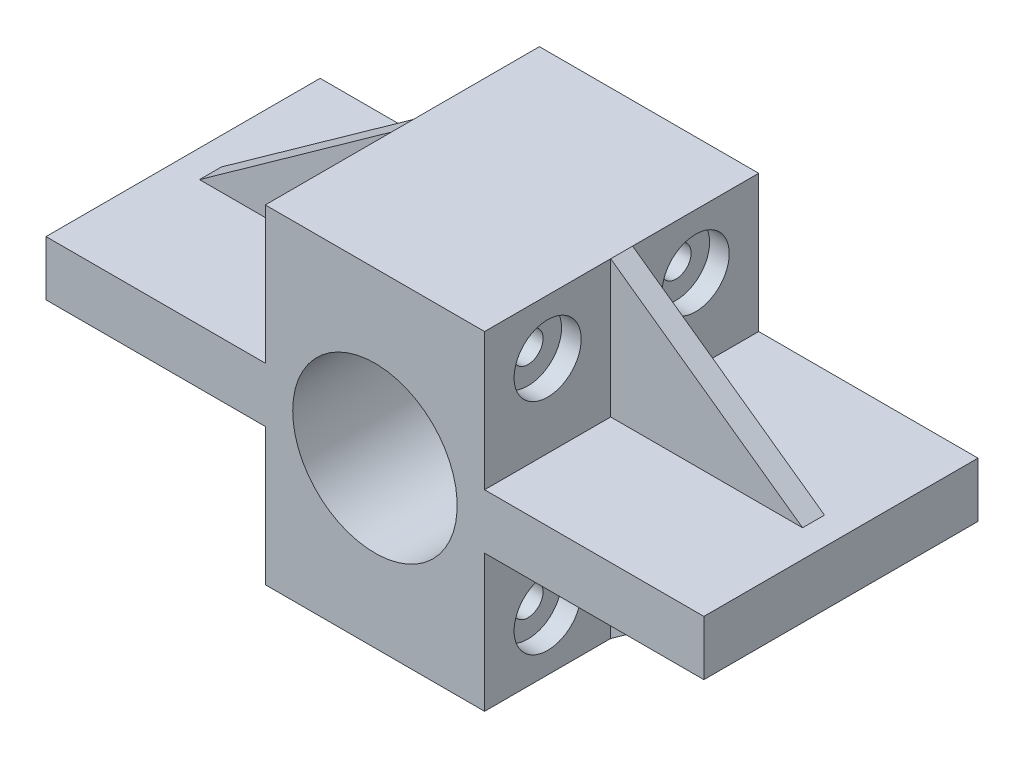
from build123d import *
from build123d.topology import SkipClean

# Parameters (mm, degrees)
EXTRUDE1_DEPTH                         = 25
RIB_REACH                              = 73.589
SKETCH4_WALL_W                         = 188.189836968
SKETCH4_WALL_H                         = 4
CBORE_FOR_M5_HEX_HEAD_BOLT3_AT_2_COUNT = 2
CBORE_FOR_M5_HEX_HEAD_BOLT3_AT_2_PITCH = 27


with BuildPart() as part:
    # Sketch1 → Extrude1 (new, symmetric)
    with BuildSketch(Plane.XY):
        with BuildLine():
            Line((-60, 0), (-15, 0))
            ThreePointArc((-15, 0), (0, 15), (15, 0))
            Line((15, 0), (60, 0))
            Line((60, 0), (60, 5))
            Line((60, 5), (20, 5))
            Line((20, 5), (20, 30))
            Line((20, 30), (-20, 30))
            Line((-20, 30), (-20, 5))
            Line((-20, 5), (-60, 5))
            Line((-60, 5), (-60, 0))
        make_face()
    extrude(amount=EXTRUDE1_DEPTH, both=True)

    # Sketch4 wall → Rib (add, up to next)
    with BuildSketch(Plane(origin=(37.5, 17.5, 0), x_dir=(0.813733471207, -0.581238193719, 0), z_dir=(0.581238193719, 0.813733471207, 0)), mode=Mode.PRIVATE) as rib_sk1:
        Rectangle(SKETCH4_WALL_W, SKETCH4_WALL_H)
    rib_tool1 = extrude(rib_sk1.sketch, amount=-RIB_REACH, mode=Mode.PRIVATE) - part.part
    rib = rib_tool1.solids().sort_by_distance((37.5, 17.5, 0))[0]
    add(rib)

    # Sketch10 → CBORE for M5 Hex Head Bolt3 (revolve, cut)
    with BuildSketch(Plane(origin=(20, 20, 13.5), x_dir=(0, 0, -1), z_dir=(0, 1, 0))):
        Polygon((0, 0), (0, 11.652366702), (2.75, 10), (2.75, 3.58), (6.12, 3.58), (6.12, 0), align=None)
    cbore_for_m5_hex_head_bolt3 = revolve(axis=Axis((26.35, 20, 13.5), (-1, 0, 0)), mode=Mode.SUBTRACT)

    # CBORE for M5 Hex Head Bolt3 at 2: CBORE for M5 Hex Head Bolt3 ×2
    with Locations(*[(0, 0, -i * CBORE_FOR_M5_HEX_HEAD_BOLT3_AT_2_PITCH) for i in range(1, CBORE_FOR_M5_HEX_HEAD_BOLT3_AT_2_COUNT)]):
        add(cbore_for_m5_hex_head_bolt3, mode=Mode.SUBTRACT)

    # Mirror13: Rib, CBORE for M5 Hex Head Bolt3 across plane
    add(rib.mirror(Plane(origin=(0, 0, 0), x_dir=(0, 0, 1), z_dir=(1, 0, 0))))
    add(cbore_for_m5_hex_head_bolt3.mirror(Plane(origin=(0, 0, 0), x_dir=(0, 0, 1), z_dir=(1, 0, 0))), mode=Mode.SUBTRACT)

    # Mirror13 copy 1 sketch → Mirror13 copy 1 (revolve, cut)
    with BuildSketch(Plane(origin=(-20, 20, -13.5), x_dir=(0, 0, -1), z_dir=(0, 1, 0))):
        Polygon((0, 0), (0, -11.652366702), (2.75, -10), (2.75, -3.58), (6.12, -3.58), (6.12, 0), align=None)
    revolve(axis=Axis((-26.35, 20, -13.5), (-1, 0, 0)), mode=Mode.SUBTRACT)

    # Mirror15: part across plane


with BuildPart() as part_1:
    with SkipClean():  # the faces are left unmerged after this step: merging them gives an invalid solid
        add(part.part)
        add(part.part.mirror(Plane(origin=(60, 0, 25), x_dir=(0, 0, 1), z_dir=(0, 1, 0))))


solid = part_1.part
